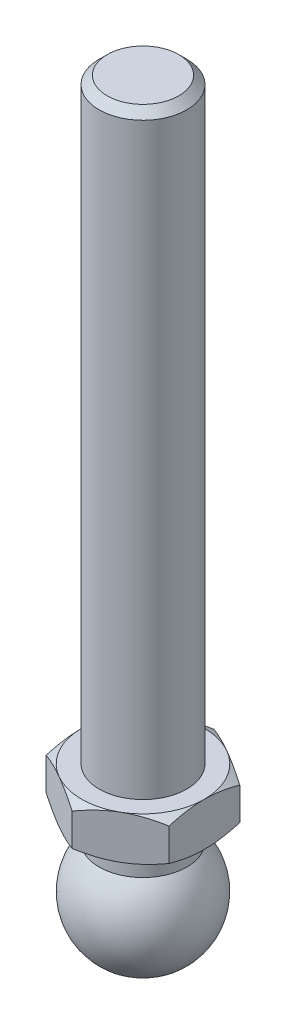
ISO-10303-21;
HEADER;
FILE_DESCRIPTION(('STEP AP214'),'2;1');
FILE_NAME('part.step','',(''),(''),'','','');
FILE_SCHEMA(('AUTOMOTIVE_DESIGN { 1 0 10303 214 1 1 1 1 }'));
ENDSEC;
DATA;
#1=APPLICATION_CONTEXT('core data for automotive mechanical design processes');
#2=APPLICATION_PROTOCOL_DEFINITION('international standard','automotive_design',2000,#1);
#3=PRODUCT_CONTEXT('',#1,'mechanical');
#4=PRODUCT('Part','Part','',(#3));
#5=PRODUCT_RELATED_PRODUCT_CATEGORY('part','',(#4));
#6=PRODUCT_DEFINITION_FORMATION('','',#4);
#7=PRODUCT_DEFINITION_CONTEXT('part definition',#1,'design');
#8=PRODUCT_DEFINITION('design','',#6,#7);
#9=PRODUCT_DEFINITION_SHAPE('','',#8);
#10=(LENGTH_UNIT() NAMED_UNIT(*) SI_UNIT(.MILLI.,.METRE.));
#11=(NAMED_UNIT(*) PLANE_ANGLE_UNIT() SI_UNIT($,.RADIAN.));
#12=(NAMED_UNIT(*) SI_UNIT($,.STERADIAN.) SOLID_ANGLE_UNIT());
#13=UNCERTAINTY_MEASURE_WITH_UNIT(LENGTH_MEASURE(1.E-05),#10,'distance_accuracy_value','');
#14=(GEOMETRIC_REPRESENTATION_CONTEXT(3) GLOBAL_UNCERTAINTY_ASSIGNED_CONTEXT((#13)) GLOBAL_UNIT_ASSIGNED_CONTEXT((#10,
#11,#12)) REPRESENTATION_CONTEXT('',''));
#15=CARTESIAN_POINT('',(0.,0.,0.));
#16=DIRECTION('',(0.,0.,1.));
#17=DIRECTION('',(1.,0.,0.));
#18=AXIS2_PLACEMENT_3D('',#15,#16,#17);
#19=CARTESIAN_POINT('',(0.,12.6,0.));
#20=DIRECTION('',(0.,-1.,0.));
#21=DIRECTION('',(0.,0.,-1.));
#22=AXIS2_PLACEMENT_3D('',#19,#20,#21);
#23=CONICAL_SURFACE('',#22,7.,1.0471975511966);
#24=CARTESIAN_POINT('',(-7.,8.53828268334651,12.1648696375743));
#25=CARTESIAN_POINT('',(-7.,8.68391573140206,11.8738003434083));
#26=CARTESIAN_POINT('',(-7.,8.82854589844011,11.5822239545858));
#27=CARTESIAN_POINT('',(-7.,9.11531569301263,10.997825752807));
#28=CARTESIAN_POINT('',(-7.,9.25745515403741,10.7050038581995));
#29=CARTESIAN_POINT('',(-7.,9.53902214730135,10.1173316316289));
#30=CARTESIAN_POINT('',(-7.,9.67844364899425,9.82247840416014));
#31=CARTESIAN_POINT('',(-7.,9.95360604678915,9.23106328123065));
#32=CARTESIAN_POINT('',(-7.,10.0893470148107,8.93450141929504));
#33=CARTESIAN_POINT('',(-7.,10.3623110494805,8.32593520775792));
#34=CARTESIAN_POINT('',(-7.,10.4993254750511,8.01383696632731));
#35=CARTESIAN_POINT('',(-7.,10.7671383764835,7.38695797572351));
#36=CARTESIAN_POINT('',(-7.,10.8979365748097,7.07217710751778));
#37=CARTESIAN_POINT('',(-7.,11.1515530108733,6.43962449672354));
#38=CARTESIAN_POINT('',(-7.,11.2743761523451,6.12185473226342));
#39=CARTESIAN_POINT('',(-7.,11.5099016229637,5.48260317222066));
#40=CARTESIAN_POINT('',(-7.,11.6226050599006,5.1611217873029));
#41=CARTESIAN_POINT('',(-7.,11.8599014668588,4.43821731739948));
#42=CARTESIAN_POINT('',(-7.,11.981118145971,4.03566892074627));
#43=CARTESIAN_POINT('',(-7.,12.1969740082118,3.22331060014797));
#44=CARTESIAN_POINT('',(-7.,12.2916155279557,2.8135013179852));
#45=CARTESIAN_POINT('',(-7.,12.4069999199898,2.19742561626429));
#46=CARTESIAN_POINT('',(-7.,12.4408518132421,1.99359214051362));
#47=CARTESIAN_POINT('',(-7.,12.4993191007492,1.58461613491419));
#48=CARTESIAN_POINT('',(-7.,12.5239358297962,1.37947379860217));
#49=CARTESIAN_POINT('',(-7.,12.5631968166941,0.968289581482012));
#50=CARTESIAN_POINT('',(-7.,12.5778439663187,0.76224797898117));
#51=CARTESIAN_POINT('',(-7.,12.5967021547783,0.349683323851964));
#52=CARTESIAN_POINT('',(-7.,12.6009132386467,0.143160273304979));
#53=CARTESIAN_POINT('',(-7.,12.5987493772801,-0.271082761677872));
#54=CARTESIAN_POINT('',(-7.,12.5923100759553,-0.47880240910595));
#55=CARTESIAN_POINT('',(-7.,12.5689433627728,-0.893645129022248));
#56=CARTESIAN_POINT('',(-7.,12.5520159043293,-1.10076819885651));
#57=CARTESIAN_POINT('',(-7.,12.5082124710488,-1.51403043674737));
#58=CARTESIAN_POINT('',(-7.,12.4813327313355,-1.72016920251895));
#59=CARTESIAN_POINT('',(-7.,12.4184180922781,-2.13103319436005));
#60=CARTESIAN_POINT('',(-7.,12.382382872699,-2.33575837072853));
#61=CARTESIAN_POINT('',(-7.,12.2605686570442,-2.95437912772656));
#62=CARTESIAN_POINT('',(-7.,12.1618729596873,-3.36575077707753));
#63=CARTESIAN_POINT('',(-7.,11.93845338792,-4.1813801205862));
#64=CARTESIAN_POINT('',(-7.,11.8137148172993,-4.58563365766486));
#65=CARTESIAN_POINT('',(-7.,11.573324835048,-5.30320893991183));
#66=CARTESIAN_POINT('',(-7.,11.4612875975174,-5.61775957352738));
#67=CARTESIAN_POINT('',(-7.,11.2278514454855,-6.24325021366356));
#68=CARTESIAN_POINT('',(-7.,11.1064551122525,-6.55419118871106));
#69=CARTESIAN_POINT('',(-7.,10.8562070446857,-7.17328528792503));
#70=CARTESIAN_POINT('',(-7.,10.7273503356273,-7.48143638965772));
#71=CARTESIAN_POINT('',(-7.,10.4637823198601,-8.09523802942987));
#72=CARTESIAN_POINT('',(-7.,10.3290706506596,-8.4008884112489));
#73=CARTESIAN_POINT('',(-7.,10.0607840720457,-8.99716345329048));
#74=CARTESIAN_POINT('',(-7.,9.92740317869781,-9.28787568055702));
#75=CARTESIAN_POINT('',(-7.,9.65714715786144,-9.86766295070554));
#76=CARTESIAN_POINT('',(-7.,9.52027208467,-10.1567380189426));
#77=CARTESIAN_POINT('',(-7.,9.24389786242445,-10.7329937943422));
#78=CARTESIAN_POINT('',(-7.,9.10440383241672,-11.0201769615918));
#79=CARTESIAN_POINT('',(-7.,8.8230228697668,-11.5933594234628));
#80=CARTESIAN_POINT('',(-7.,8.68113600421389,-11.879358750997));
#81=CARTESIAN_POINT('',(-7.,8.53828268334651,-12.1648696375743));
#82=B_SPLINE_CURVE_WITH_KNOTS('',3,(#24,#25,#26,#27,#28,#29,#30,#31,#32,#33,#34,#35,#36,#37,#38,
#39,#40,#41,#42,#43,#44,#45,#46,#47,#48,#49,#50,#51,#52,#53,#54,#55,#56,#57,#58,#59,#60,#61,#62,
#63,#64,#65,#66,#67,#68,#69,#70,#71,#72,#73,#74,#75,#76,#77,#78,#79,#80,#81),.UNSPECIFIED.,.F.,
.F.,(4,2,2,2,2,2,2,2,2,2,2,2,2,2,2,2,2,2,2,2,2,2,2,2,2,2,2,2,4),(0.,0.976413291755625,
1.9528916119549,2.9313342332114,3.90975772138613,4.93225217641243,5.95479223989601,
6.97669748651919,7.99849072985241,9.25906449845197,10.5195273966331,11.1392271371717,
11.758837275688,12.3782676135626,12.9976952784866,13.6208795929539,14.244066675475,
14.8674897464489,15.4909346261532,16.7587972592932,18.0273773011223,19.0289263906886,
20.0302002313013,21.0321496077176,22.034161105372,22.9936838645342,23.9531917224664,
24.9109871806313,25.8687558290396),.UNSPECIFIED.);
#83=CARTESIAN_POINT('',(-7.,11.9747852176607,4.04145188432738));
#84=VERTEX_POINT('',#83);
#85=CARTESIAN_POINT('',(-7.,12.6,0.));
#86=VERTEX_POINT('',#85);
#87=EDGE_CURVE('E309',#84,#86,#82,.T.);
#88=ORIENTED_EDGE('',*,*,#87,.F.);
#89=CARTESIAN_POINT('',(0.0002,11.9747185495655,8.0830192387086));
#90=CARTESIAN_POINT('',(-0.15366790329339,12.0260001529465,7.99418356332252));
#91=CARTESIAN_POINT('',(-0.308109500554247,12.0749544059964,7.90501666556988));
#92=CARTESIAN_POINT('',(-0.618246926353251,12.1675672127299,7.72595873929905));
#93=CARTESIAN_POINT('',(-0.773943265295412,12.2112234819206,7.63606741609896));
#94=CARTESIAN_POINT('',(-1.24352516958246,12.3333884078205,7.36495417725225));
#95=CARTESIAN_POINT('',(-1.5592643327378,12.4028744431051,7.18266208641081));
#96=CARTESIAN_POINT('',(-2.03176224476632,12.4843550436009,6.9098652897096));
#97=CARTESIAN_POINT('',(-2.18710922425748,12.5075665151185,6.82017566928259));
#98=CARTESIAN_POINT('',(-2.49850511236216,12.5464887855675,6.64039116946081));
#99=CARTESIAN_POINT('',(-2.6545539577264,12.5622002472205,6.55029632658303));
#100=CARTESIAN_POINT('',(-2.96692267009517,12.5857220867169,6.36995016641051));
#101=CARTESIAN_POINT('',(-3.12324202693,12.5935414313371,6.27969914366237));
#102=CARTESIAN_POINT('',(-3.43601650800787,12.6011197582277,6.09911871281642));
#103=CARTESIAN_POINT('',(-3.59247162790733,12.600878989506,6.00878930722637));
#104=CARTESIAN_POINT('',(-4.02110687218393,12.5891402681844,5.76131663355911));
#105=CARTESIAN_POINT('',(-4.29314668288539,12.5694342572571,5.60425437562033));
#106=CARTESIAN_POINT('',(-4.83541944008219,12.5069465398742,5.29117305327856));
#107=CARTESIAN_POINT('',(-5.10565047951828,12.464143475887,5.13515508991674));
#108=CARTESIAN_POINT('',(-5.64901454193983,12.3571483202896,4.82144370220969));
#109=CARTESIAN_POINT('',(-5.92207900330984,12.2925029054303,4.66378986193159));
#110=CARTESIAN_POINT('',(-6.46413578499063,12.145783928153,4.35083323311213));
#111=CARTESIAN_POINT('',(-6.73313504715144,12.0637448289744,4.19552643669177));
#112=CARTESIAN_POINT('',(-7.0002,11.9747185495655,4.04133641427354));
#113=B_SPLINE_CURVE_WITH_KNOTS('',3,(#89,#90,#91,#92,#93,#94,#95,#96,#97,#98,#99,#100,#101,#102,
#103,#104,#105,#106,#107,#108,#109,#110,#111,#112),.UNSPECIFIED.,.F.,.F.,(4,2,2,2,2,2,2,2,2,2,2,
4),(0.,0.554727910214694,1.10969417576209,2.2219327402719,2.76443041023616,3.30688013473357,
3.84871284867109,4.39052882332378,5.33376515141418,6.27787517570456,7.2429241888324,
8.20607866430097),.UNSPECIFIED.);
#114=CARTESIAN_POINT('',(-3.5,12.6,6.06217782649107));
#115=VERTEX_POINT('',#114);
#116=EDGE_CURVE('E135',#115,#84,#113,.T.);
#117=ORIENTED_EDGE('',*,*,#116,.F.);
#118=CARTESIAN_POINT('',(0.,12.6,0.));
#119=DIRECTION('',(0.,-1.,0.));
#120=DIRECTION('',(0.,0.,-1.));
#121=AXIS2_PLACEMENT_3D('',#118,#119,#120);
#122=CIRCLE('',#121,7.);
#123=EDGE_CURVE('E283',#115,#86,#122,.T.);
#124=ORIENTED_EDGE('',*,*,#123,.T.);
#125=EDGE_LOOP('',(#88,#117,#124));
#126=FACE_BOUND('',#125,.T.);
#127=ADVANCED_FACE('F14',(#126),#23,.T.);
#128=CARTESIAN_POINT('',(-7.,11.9747852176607,-4.04145188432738));
#129=VERTEX_POINT('',#128);
#130=EDGE_CURVE('E193',#86,#129,#82,.T.);
#131=ORIENTED_EDGE('',*,*,#130,.F.);
#132=CARTESIAN_POINT('',(-3.5,12.6,-6.06217782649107));
#133=VERTEX_POINT('',#132);
#134=EDGE_CURVE('E195',#86,#133,#122,.T.);
#135=ORIENTED_EDGE('',*,*,#134,.T.);
#136=CARTESIAN_POINT('',(-7.0002,11.9747185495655,-4.04133641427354));
#137=CARTESIAN_POINT('',(-6.84633209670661,12.0260001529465,-4.13017208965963));
#138=CARTESIAN_POINT('',(-6.69189049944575,12.0749544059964,-4.21933898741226));
#139=CARTESIAN_POINT('',(-6.38175307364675,12.1675672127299,-4.39839691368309));
#140=CARTESIAN_POINT('',(-6.22605673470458,12.2112234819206,-4.48828823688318));
#141=CARTESIAN_POINT('',(-5.75647483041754,12.3333884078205,-4.75940147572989));
#142=CARTESIAN_POINT('',(-5.4407356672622,12.4028744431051,-4.94169356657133));
#143=CARTESIAN_POINT('',(-4.96823775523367,12.4843550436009,-5.21449036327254));
#144=CARTESIAN_POINT('',(-4.81289077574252,12.5075665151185,-5.30417998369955));
#145=CARTESIAN_POINT('',(-4.50149488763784,12.5464887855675,-5.48396448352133));
#146=CARTESIAN_POINT('',(-4.3454460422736,12.5622002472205,-5.5740593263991));
#147=CARTESIAN_POINT('',(-4.03307732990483,12.5857220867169,-5.75440548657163));
#148=CARTESIAN_POINT('',(-3.87675797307,12.5935414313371,-5.84465650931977));
#149=CARTESIAN_POINT('',(-3.56398349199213,12.6011197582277,-6.02523694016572));
#150=CARTESIAN_POINT('',(-3.40752837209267,12.600878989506,-6.11556634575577));
#151=CARTESIAN_POINT('',(-2.97889312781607,12.5891402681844,-6.36303901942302));
#152=CARTESIAN_POINT('',(-2.70685331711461,12.5694342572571,-6.52010127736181));
#153=CARTESIAN_POINT('',(-2.16458055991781,12.5069465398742,-6.83318259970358));
#154=CARTESIAN_POINT('',(-1.89434952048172,12.464143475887,-6.9892005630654));
#155=CARTESIAN_POINT('',(-1.35098545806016,12.3571483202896,-7.30291195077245));
#156=CARTESIAN_POINT('',(-1.07792099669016,12.2925029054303,-7.46056579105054));
#157=CARTESIAN_POINT('',(-0.535864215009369,12.145783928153,-7.77352241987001));
#158=CARTESIAN_POINT('',(-0.266864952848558,12.0637448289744,-7.92882921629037));
#159=CARTESIAN_POINT('',(0.000200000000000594,11.9747185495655,-8.0830192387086));
#160=B_SPLINE_CURVE_WITH_KNOTS('',3,(#136,#137,#138,#139,#140,#141,#142,#143,#144,#145,#146,
#147,#148,#149,#150,#151,#152,#153,#154,#155,#156,#157,#158,#159),.UNSPECIFIED.,.F.,.F.,(4,2,2,
2,2,2,2,2,2,2,2,4),(0.,0.554727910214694,1.10969417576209,2.22193274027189,2.76443041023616,
3.30688013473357,3.84871284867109,4.39052882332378,5.33376515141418,6.27787517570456,
7.2429241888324,8.20607866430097),.UNSPECIFIED.);
#161=EDGE_CURVE('E183',#129,#133,#160,.T.);
#162=ORIENTED_EDGE('',*,*,#161,.F.);
#163=EDGE_LOOP('',(#131,#135,#162));
#164=FACE_BOUND('',#163,.T.);
#165=ADVANCED_FACE('F192',(#164),#23,.T.);
#166=CARTESIAN_POINT('',(0.,11.9747852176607,-8.08290376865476));
#167=VERTEX_POINT('',#166);
#168=EDGE_CURVE('E197',#133,#167,#160,.T.);
#169=ORIENTED_EDGE('',*,*,#168,.F.);
#170=CARTESIAN_POINT('',(3.5,12.6,-6.06217782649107));
#171=VERTEX_POINT('',#170);
#172=EDGE_CURVE('E293',#133,#171,#122,.T.);
#173=ORIENTED_EDGE('',*,*,#172,.T.);
#174=CARTESIAN_POINT('',(-0.0002,11.9747185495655,-8.0830192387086));
#175=CARTESIAN_POINT('',(0.15366790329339,12.0260001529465,-7.99418356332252));
#176=CARTESIAN_POINT('',(0.308109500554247,12.0749544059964,-7.90501666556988));
#177=CARTESIAN_POINT('',(0.618246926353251,12.1675672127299,-7.72595873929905));
#178=CARTESIAN_POINT('',(0.773943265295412,12.2112234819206,-7.63606741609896));
#179=CARTESIAN_POINT('',(1.24352516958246,12.3333884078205,-7.36495417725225));
#180=CARTESIAN_POINT('',(1.5592643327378,12.4028744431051,-7.18266208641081));
#181=CARTESIAN_POINT('',(2.03176224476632,12.4843550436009,-6.9098652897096));
#182=CARTESIAN_POINT('',(2.18710922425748,12.5075665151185,-6.82017566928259));
#183=CARTESIAN_POINT('',(2.49850511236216,12.5464887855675,-6.64039116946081));
#184=CARTESIAN_POINT('',(2.6545539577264,12.5622002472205,-6.55029632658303));
#185=CARTESIAN_POINT('',(2.96692267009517,12.5857220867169,-6.36995016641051));
#186=CARTESIAN_POINT('',(3.12324202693,12.5935414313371,-6.27969914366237));
#187=CARTESIAN_POINT('',(3.43601650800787,12.6011197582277,-6.09911871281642));
#188=CARTESIAN_POINT('',(3.59247162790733,12.600878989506,-6.00878930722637));
#189=CARTESIAN_POINT('',(4.02110687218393,12.5891402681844,-5.76131663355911));
#190=CARTESIAN_POINT('',(4.29314668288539,12.5694342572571,-5.60425437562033));
#191=CARTESIAN_POINT('',(4.83541944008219,12.5069465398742,-5.29117305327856));
#192=CARTESIAN_POINT('',(5.10565047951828,12.464143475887,-5.13515508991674));
#193=CARTESIAN_POINT('',(5.64901454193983,12.3571483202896,-4.82144370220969));
#194=CARTESIAN_POINT('',(5.92207900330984,12.2925029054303,-4.66378986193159));
#195=CARTESIAN_POINT('',(6.46413578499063,12.145783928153,-4.35083323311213));
#196=CARTESIAN_POINT('',(6.73313504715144,12.0637448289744,-4.19552643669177));
#197=CARTESIAN_POINT('',(7.0002,11.9747185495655,-4.04133641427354));
#198=B_SPLINE_CURVE_WITH_KNOTS('',3,(#174,#175,#176,#177,#178,#179,#180,#181,#182,#183,#184,
#185,#186,#187,#188,#189,#190,#191,#192,#193,#194,#195,#196,#197),.UNSPECIFIED.,.F.,.F.,(4,2,2,
2,2,2,2,2,2,2,2,4),(0.,0.554727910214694,1.10969417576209,2.2219327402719,2.76443041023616,
3.30688013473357,3.84871284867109,4.39052882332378,5.33376515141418,6.27787517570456,
7.2429241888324,8.20607866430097),.UNSPECIFIED.);
#199=EDGE_CURVE('E243',#167,#171,#198,.T.);
#200=ORIENTED_EDGE('',*,*,#199,.F.);
#201=EDGE_LOOP('',(#169,#173,#200));
#202=FACE_BOUND('',#201,.T.);
#203=ADVANCED_FACE('F342',(#202),#23,.T.);
#204=CARTESIAN_POINT('',(7.,11.9747852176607,-4.04145188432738));
#205=VERTEX_POINT('',#204);
#206=EDGE_CURVE('E238',#171,#205,#198,.T.);
#207=ORIENTED_EDGE('',*,*,#206,.F.);
#208=CARTESIAN_POINT('',(7.,12.6,0.));
#209=VERTEX_POINT('',#208);
#210=EDGE_CURVE('E288',#171,#209,#122,.T.);
#211=ORIENTED_EDGE('',*,*,#210,.T.);
#212=CARTESIAN_POINT('',(7.,8.53828268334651,-12.1648696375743));
#213=CARTESIAN_POINT('',(7.,8.68391573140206,-11.8738003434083));
#214=CARTESIAN_POINT('',(7.,8.82854589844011,-11.5822239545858));
#215=CARTESIAN_POINT('',(7.,9.11531569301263,-10.997825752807));
#216=CARTESIAN_POINT('',(7.,9.25745515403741,-10.7050038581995));
#217=CARTESIAN_POINT('',(7.,9.53902214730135,-10.1173316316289));
#218=CARTESIAN_POINT('',(7.,9.67844364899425,-9.82247840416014));
#219=CARTESIAN_POINT('',(7.,9.95360604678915,-9.23106328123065));
#220=CARTESIAN_POINT('',(7.,10.0893470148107,-8.93450141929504));
#221=CARTESIAN_POINT('',(7.,10.3623110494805,-8.32593520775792));
#222=CARTESIAN_POINT('',(7.,10.4993254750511,-8.01383696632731));
#223=CARTESIAN_POINT('',(7.,10.7671383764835,-7.38695797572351));
#224=CARTESIAN_POINT('',(7.,10.8979365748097,-7.07217710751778));
#225=CARTESIAN_POINT('',(7.,11.1515530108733,-6.43962449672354));
#226=CARTESIAN_POINT('',(7.,11.2743761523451,-6.12185473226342));
#227=CARTESIAN_POINT('',(7.,11.5099016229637,-5.48260317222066));
#228=CARTESIAN_POINT('',(7.,11.6226050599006,-5.1611217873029));
#229=CARTESIAN_POINT('',(7.,11.8599014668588,-4.43821731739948));
#230=CARTESIAN_POINT('',(7.,11.981118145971,-4.03566892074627));
#231=CARTESIAN_POINT('',(7.,12.1969740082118,-3.22331060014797));
#232=CARTESIAN_POINT('',(7.,12.2916155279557,-2.8135013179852));
#233=CARTESIAN_POINT('',(7.,12.4069999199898,-2.19742561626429));
#234=CARTESIAN_POINT('',(7.,12.4408518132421,-1.99359214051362));
#235=CARTESIAN_POINT('',(7.,12.4993191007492,-1.58461613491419));
#236=CARTESIAN_POINT('',(7.,12.5239358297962,-1.37947379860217));
#237=CARTESIAN_POINT('',(7.,12.5631968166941,-0.968289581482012));
#238=CARTESIAN_POINT('',(7.,12.5778439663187,-0.76224797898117));
#239=CARTESIAN_POINT('',(7.,12.5967021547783,-0.349683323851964));
#240=CARTESIAN_POINT('',(7.,12.6009132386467,-0.143160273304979));
#241=CARTESIAN_POINT('',(7.,12.5987493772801,0.271082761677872));
#242=CARTESIAN_POINT('',(7.,12.5923100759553,0.47880240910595));
#243=CARTESIAN_POINT('',(7.,12.5689433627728,0.893645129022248));
#244=CARTESIAN_POINT('',(7.,12.5520159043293,1.10076819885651));
#245=CARTESIAN_POINT('',(7.,12.5082124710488,1.51403043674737));
#246=CARTESIAN_POINT('',(7.,12.4813327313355,1.72016920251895));
#247=CARTESIAN_POINT('',(7.,12.4184180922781,2.13103319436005));
#248=CARTESIAN_POINT('',(7.,12.382382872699,2.33575837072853));
#249=CARTESIAN_POINT('',(7.,12.2605686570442,2.95437912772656));
#250=CARTESIAN_POINT('',(7.,12.1618729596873,3.36575077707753));
#251=CARTESIAN_POINT('',(7.,11.93845338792,4.1813801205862));
#252=CARTESIAN_POINT('',(7.,11.8137148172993,4.58563365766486));
#253=CARTESIAN_POINT('',(7.,11.573324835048,5.30320893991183));
#254=CARTESIAN_POINT('',(7.,11.4612875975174,5.61775957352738));
#255=CARTESIAN_POINT('',(7.,11.2278514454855,6.24325021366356));
#256=CARTESIAN_POINT('',(7.,11.1064551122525,6.55419118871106));
#257=CARTESIAN_POINT('',(7.,10.8562070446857,7.17328528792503));
#258=CARTESIAN_POINT('',(7.,10.7273503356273,7.48143638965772));
#259=CARTESIAN_POINT('',(7.,10.4637823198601,8.09523802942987));
#260=CARTESIAN_POINT('',(7.,10.3290706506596,8.4008884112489));
#261=CARTESIAN_POINT('',(7.,10.0607840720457,8.99716345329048));
#262=CARTESIAN_POINT('',(7.,9.92740317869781,9.28787568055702));
#263=CARTESIAN_POINT('',(7.,9.65714715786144,9.86766295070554));
#264=CARTESIAN_POINT('',(7.,9.52027208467,10.1567380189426));
#265=CARTESIAN_POINT('',(7.,9.24389786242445,10.7329937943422));
#266=CARTESIAN_POINT('',(7.,9.10440383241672,11.0201769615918));
#267=CARTESIAN_POINT('',(7.,8.8230228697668,11.5933594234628));
#268=CARTESIAN_POINT('',(7.,8.68113600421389,11.879358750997));
#269=CARTESIAN_POINT('',(7.,8.53828268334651,12.1648696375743));
#270=B_SPLINE_CURVE_WITH_KNOTS('',3,(#212,#213,#214,#215,#216,#217,#218,#219,#220,#221,#222,
#223,#224,#225,#226,#227,#228,#229,#230,#231,#232,#233,#234,#235,#236,#237,#238,#239,#240,#241,
#242,#243,#244,#245,#246,#247,#248,#249,#250,#251,#252,#253,#254,#255,#256,#257,#258,#259,#260,
#261,#262,#263,#264,#265,#266,#267,#268,#269),.UNSPECIFIED.,.F.,.F.,(4,2,2,2,2,2,2,2,2,2,2,2,2,
2,2,2,2,2,2,2,2,2,2,2,2,2,2,2,4),(0.,0.976413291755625,1.9528916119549,2.9313342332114,
3.90975772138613,4.93225217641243,5.95479223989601,6.97669748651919,7.99849072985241,
9.25906449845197,10.5195273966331,11.1392271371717,11.758837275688,12.3782676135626,
12.9976952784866,13.6208795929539,14.244066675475,14.8674897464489,15.4909346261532,
16.7587972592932,18.0273773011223,19.0289263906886,20.0302002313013,21.0321496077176,
22.034161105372,22.9936838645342,23.9531917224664,24.9109871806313,25.8687558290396),.UNSPECIFIED.);
#271=EDGE_CURVE('E249',#205,#209,#270,.T.);
#272=ORIENTED_EDGE('',*,*,#271,.F.);
#273=EDGE_LOOP('',(#207,#211,#272));
#274=FACE_BOUND('',#273,.T.);
#275=ADVANCED_FACE('F352',(#274),#23,.T.);
#276=CARTESIAN_POINT('',(7.,11.9747852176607,4.04145188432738));
#277=VERTEX_POINT('',#276);
#278=EDGE_CURVE('E251',#209,#277,#270,.T.);
#279=ORIENTED_EDGE('',*,*,#278,.F.);
#280=CARTESIAN_POINT('',(3.5,12.6,6.06217782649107));
#281=VERTEX_POINT('',#280);
#282=EDGE_CURVE('E281',#209,#281,#122,.T.);
#283=ORIENTED_EDGE('',*,*,#282,.T.);
#284=CARTESIAN_POINT('',(7.0002,11.9747185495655,4.04133641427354));
#285=CARTESIAN_POINT('',(6.84633209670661,12.0260001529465,4.13017208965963));
#286=CARTESIAN_POINT('',(6.69189049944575,12.0749544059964,4.21933898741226));
#287=CARTESIAN_POINT('',(6.38175307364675,12.1675672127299,4.39839691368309));
#288=CARTESIAN_POINT('',(6.22605673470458,12.2112234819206,4.48828823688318));
#289=CARTESIAN_POINT('',(5.75647483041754,12.3333884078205,4.75940147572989));
#290=CARTESIAN_POINT('',(5.4407356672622,12.4028744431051,4.94169356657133));
#291=CARTESIAN_POINT('',(4.96823775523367,12.4843550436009,5.21449036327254));
#292=CARTESIAN_POINT('',(4.81289077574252,12.5075665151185,5.30417998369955));
#293=CARTESIAN_POINT('',(4.50149488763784,12.5464887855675,5.48396448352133));
#294=CARTESIAN_POINT('',(4.3454460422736,12.5622002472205,5.5740593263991));
#295=CARTESIAN_POINT('',(4.03307732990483,12.5857220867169,5.75440548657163));
#296=CARTESIAN_POINT('',(3.87675797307,12.5935414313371,5.84465650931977));
#297=CARTESIAN_POINT('',(3.56398349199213,12.6011197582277,6.02523694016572));
#298=CARTESIAN_POINT('',(3.40752837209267,12.600878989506,6.11556634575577));
#299=CARTESIAN_POINT('',(2.97889312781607,12.5891402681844,6.36303901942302));
#300=CARTESIAN_POINT('',(2.70685331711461,12.5694342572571,6.52010127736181));
#301=CARTESIAN_POINT('',(2.16458055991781,12.5069465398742,6.83318259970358));
#302=CARTESIAN_POINT('',(1.89434952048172,12.464143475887,6.9892005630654));
#303=CARTESIAN_POINT('',(1.35098545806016,12.3571483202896,7.30291195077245));
#304=CARTESIAN_POINT('',(1.07792099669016,12.2925029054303,7.46056579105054));
#305=CARTESIAN_POINT('',(0.535864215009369,12.145783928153,7.77352241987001));
#306=CARTESIAN_POINT('',(0.266864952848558,12.0637448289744,7.92882921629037));
#307=CARTESIAN_POINT('',(-0.000200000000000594,11.9747185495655,8.0830192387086));
#308=B_SPLINE_CURVE_WITH_KNOTS('',3,(#284,#285,#286,#287,#288,#289,#290,#291,#292,#293,#294,
#295,#296,#297,#298,#299,#300,#301,#302,#303,#304,#305,#306,#307),.UNSPECIFIED.,.F.,.F.,(4,2,2,
2,2,2,2,2,2,2,2,4),(0.,0.554727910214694,1.10969417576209,2.22193274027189,2.76443041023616,
3.30688013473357,3.84871284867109,4.39052882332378,5.33376515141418,6.27787517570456,
7.2429241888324,8.20607866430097),.UNSPECIFIED.);
#309=EDGE_CURVE('E126',#277,#281,#308,.T.);
#310=ORIENTED_EDGE('',*,*,#309,.F.);
#311=EDGE_LOOP('',(#279,#283,#310));
#312=FACE_BOUND('',#311,.T.);
#313=ADVANCED_FACE('F285',(#312),#23,.T.);
#314=CARTESIAN_POINT('',(0.,11.9747852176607,8.08290376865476));
#315=VERTEX_POINT('',#314);
#316=EDGE_CURVE('E116',#281,#315,#308,.T.);
#317=ORIENTED_EDGE('',*,*,#316,.F.);
#318=EDGE_CURVE('E274',#281,#115,#122,.T.);
#319=ORIENTED_EDGE('',*,*,#318,.T.);
#320=EDGE_CURVE('E29',#315,#115,#113,.T.);
#321=ORIENTED_EDGE('',*,*,#320,.F.);
#322=EDGE_LOOP('',(#317,#319,#321));
#323=FACE_BOUND('',#322,.T.);
#324=ADVANCED_FACE('F273',(#323),#23,.T.);
#325=CARTESIAN_POINT('',(0.,80.6,0.));
#326=DIRECTION('',(0.,-1.,0.));
#327=DIRECTION('',(0.,0.,-1.));
#328=AXIS2_PLACEMENT_3D('',#325,#326,#327);
#329=PLANE('',#328);
#330=CARTESIAN_POINT('',(0.,80.6,0.));
#331=DIRECTION('',(0.,-1.,0.));
#332=DIRECTION('',(0.,0.,-1.));
#333=AXIS2_PLACEMENT_3D('',#330,#331,#332);
#334=CIRCLE('',#333,4.08);
#335=CARTESIAN_POINT('',(0.,80.6,-4.08));
#336=VERTEX_POINT('',#335);
#337=EDGE_CURVE('E22',#336,#336,#334,.T.);
#338=ORIENTED_EDGE('',*,*,#337,.F.);
#339=EDGE_LOOP('',(#338));
#340=FACE_BOUND('',#339,.T.);
#341=ADVANCED_FACE('F16',(#340),#329,.F.);
#342=CARTESIAN_POINT('',(0.,80.6,0.));
#343=DIRECTION('',(0.,-1.,0.));
#344=DIRECTION('',(0.,0.,-1.));
#345=AXIS2_PLACEMENT_3D('',#342,#343,#344);
#346=CONICAL_SURFACE('',#345,4.08,0.785398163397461);
#347=CARTESIAN_POINT('',(0.,79.68,0.));
#348=DIRECTION('',(0.,-1.,0.));
#349=DIRECTION('',(0.,0.,-1.));
#350=AXIS2_PLACEMENT_3D('',#347,#348,#349);
#351=CIRCLE('',#350,5.);
#352=CARTESIAN_POINT('',(0.,79.68,-5.));
#353=VERTEX_POINT('',#352);
#354=EDGE_CURVE('E290',#353,#353,#351,.T.);
#355=ORIENTED_EDGE('',*,*,#354,.F.);
#356=EDGE_LOOP('',(#355));
#357=FACE_BOUND('',#356,.T.);
#358=ORIENTED_EDGE('',*,*,#337,.T.);
#359=EDGE_LOOP('',(#358));
#360=FACE_BOUND('',#359,.T.);
#361=ADVANCED_FACE('F350',(#357,#360),#346,.T.);
#362=CARTESIAN_POINT('',(0.,-7.,0.));
#363=DIRECTION('',(0.,-1.,0.));
#364=DIRECTION('',(0.,0.,-1.));
#365=AXIS2_PLACEMENT_3D('',#362,#363,#364);
#366=CYLINDRICAL_SURFACE('',#365,5.);
#367=CARTESIAN_POINT('',(0.,12.6,0.));
#368=DIRECTION('',(0.,-1.,0.));
#369=DIRECTION('',(0.,0.,-1.));
#370=AXIS2_PLACEMENT_3D('',#367,#368,#369);
#371=CIRCLE('',#370,5.);
#372=CARTESIAN_POINT('',(0.,12.6,-5.));
#373=VERTEX_POINT('',#372);
#374=EDGE_CURVE('E287',#373,#373,#371,.T.);
#375=ORIENTED_EDGE('',*,*,#374,.F.);
#376=EDGE_LOOP('',(#375));
#377=FACE_BOUND('',#376,.T.);
#378=ORIENTED_EDGE('',*,*,#354,.T.);
#379=EDGE_LOOP('',(#378));
#380=FACE_BOUND('',#379,.T.);
#381=ADVANCED_FACE('F427',(#377,#380),#366,.T.);
#382=CARTESIAN_POINT('',(5.,12.6,0.));
#383=DIRECTION('',(0.,-1.,0.));
#384=DIRECTION('',(0.,0.,-1.));
#385=AXIS2_PLACEMENT_3D('',#382,#383,#384);
#386=PLANE('',#385);
#387=ORIENTED_EDGE('',*,*,#282,.F.);
#388=ORIENTED_EDGE('',*,*,#210,.F.);
#389=ORIENTED_EDGE('',*,*,#172,.F.);
#390=ORIENTED_EDGE('',*,*,#134,.F.);
#391=ORIENTED_EDGE('',*,*,#123,.F.);
#392=ORIENTED_EDGE('',*,*,#318,.F.);
#393=EDGE_LOOP('',(#387,#388,#389,#390,#391,#392));
#394=FACE_BOUND('',#393,.T.);
#395=ORIENTED_EDGE('',*,*,#374,.T.);
#396=EDGE_LOOP('',(#395));
#397=FACE_BOUND('',#396,.T.);
#398=ADVANCED_FACE('F278',(#394,#397),#386,.F.);
#399=CARTESIAN_POINT('',(-7.,7.65,-4.04145188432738));
#400=DIRECTION('',(-1.,0.,0.));
#401=DIRECTION('',(0.,0.,1.));
#402=AXIS2_PLACEMENT_3D('',#399,#400,#401);
#403=PLANE('',#402);
#404=ORIENTED_EDGE('',*,*,#87,.T.);
#405=ORIENTED_EDGE('',*,*,#130,.T.);
#406=DIRECTION('',(0.,1.,0.));
#407=VECTOR('',#406,1.);
#408=CARTESIAN_POINT('',(-7.,7.65,-4.04145188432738));
#409=LINE('',#408,#407);
#410=CARTESIAN_POINT('',(-7.,8.27521478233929,-4.04145188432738));
#411=VERTEX_POINT('',#410);
#412=EDGE_CURVE('E109',#411,#129,#409,.T.);
#413=ORIENTED_EDGE('',*,*,#412,.F.);
#414=CARTESIAN_POINT('',(-7.,11.7117173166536,-12.1648696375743));
#415=CARTESIAN_POINT('',(-7.,11.566084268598,-11.8738003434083));
#416=CARTESIAN_POINT('',(-7.,11.42145410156,-11.5822239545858));
#417=CARTESIAN_POINT('',(-7.,11.1346843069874,-10.997825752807));
#418=CARTESIAN_POINT('',(-7.,10.9925448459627,-10.7050038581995));
#419=CARTESIAN_POINT('',(-7.,10.7109778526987,-10.1173316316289));
#420=CARTESIAN_POINT('',(-7.,10.5715563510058,-9.82247840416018));
#421=CARTESIAN_POINT('',(-7.,10.2963939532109,-9.2310632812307));
#422=CARTESIAN_POINT('',(-7.,10.1606529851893,-8.93450141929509));
#423=CARTESIAN_POINT('',(-7.,9.88768895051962,-8.32593520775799));
#424=CARTESIAN_POINT('',(-7.,9.75067452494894,-8.01383696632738));
#425=CARTESIAN_POINT('',(-7.,9.48286162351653,-7.38695797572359));
#426=CARTESIAN_POINT('',(-7.,9.3520634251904,-7.07217710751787));
#427=CARTESIAN_POINT('',(-7.,9.09844698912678,-6.43962449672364));
#428=CARTESIAN_POINT('',(-7.,8.97562384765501,-6.12185473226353));
#429=CARTESIAN_POINT('',(-7.,8.7400983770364,-5.48260317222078));
#430=CARTESIAN_POINT('',(-7.,8.62739494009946,-5.16112178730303));
#431=CARTESIAN_POINT('',(-7.,8.39009853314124,-4.43821731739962));
#432=CARTESIAN_POINT('',(-7.,8.26888185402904,-4.03566892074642));
#433=CARTESIAN_POINT('',(-7.,8.05302599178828,-3.22331060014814));
#434=CARTESIAN_POINT('',(-7.,7.95838447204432,-2.81350131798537));
#435=CARTESIAN_POINT('',(-7.,7.84300008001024,-2.19742561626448));
#436=CARTESIAN_POINT('',(-7.,7.80914818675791,-1.99359214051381));
#437=CARTESIAN_POINT('',(-7.,7.75068089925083,-1.58461613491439));
#438=CARTESIAN_POINT('',(-7.,7.7260641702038,-1.37947379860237));
#439=CARTESIAN_POINT('',(-7.,7.68680318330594,-0.968289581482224));
#440=CARTESIAN_POINT('',(-7.,7.67215603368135,-0.762247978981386));
#441=CARTESIAN_POINT('',(-7.,7.65329784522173,-0.349683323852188));
#442=CARTESIAN_POINT('',(-7.,7.64908676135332,-0.143160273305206));
#443=CARTESIAN_POINT('',(-7.,7.65125062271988,0.27108276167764));
#444=CARTESIAN_POINT('',(-7.,7.65768992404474,0.478802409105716));
#445=CARTESIAN_POINT('',(-7.,7.68105663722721,0.893645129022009));
#446=CARTESIAN_POINT('',(-7.,7.69798409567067,1.10076819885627));
#447=CARTESIAN_POINT('',(-7.,7.74178752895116,1.51403043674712));
#448=CARTESIAN_POINT('',(-7.,7.76866726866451,1.7201692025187));
#449=CARTESIAN_POINT('',(-7.,7.83158190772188,2.1310331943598));
#450=CARTESIAN_POINT('',(-7.,7.86761712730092,2.33575837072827));
#451=CARTESIAN_POINT('',(-7.,7.98943134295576,2.95437912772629));
#452=CARTESIAN_POINT('',(-7.,8.08812704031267,3.36575077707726));
#453=CARTESIAN_POINT('',(-7.,8.31154661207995,4.18138012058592));
#454=CARTESIAN_POINT('',(-7.,8.43628518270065,4.58563365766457));
#455=CARTESIAN_POINT('',(-7.,8.67667516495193,5.30320893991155));
#456=CARTESIAN_POINT('',(-7.,8.78871240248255,5.61775957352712));
#457=CARTESIAN_POINT('',(-7.,9.02214855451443,6.24325021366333));
#458=CARTESIAN_POINT('',(-7.,9.14354488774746,6.55419118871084));
#459=CARTESIAN_POINT('',(-7.,9.3937929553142,7.17328528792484));
#460=CARTESIAN_POINT('',(-7.,9.52264966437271,7.48143638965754));
#461=CARTESIAN_POINT('',(-7.,9.78621768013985,8.09523802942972));
#462=CARTESIAN_POINT('',(-7.,9.92092934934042,8.40088841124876));
#463=CARTESIAN_POINT('',(-7.,10.1892159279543,8.99716345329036));
#464=CARTESIAN_POINT('',(-7.,10.3225968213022,9.28787568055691));
#465=CARTESIAN_POINT('',(-7.,10.5928528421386,9.86766295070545));
#466=CARTESIAN_POINT('',(-7.,10.72972791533,10.1567380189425));
#467=CARTESIAN_POINT('',(-7.,11.0061021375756,10.7329937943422));
#468=CARTESIAN_POINT('',(-7.,11.1455961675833,11.0201769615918));
#469=CARTESIAN_POINT('',(-7.,11.4269771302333,11.5933594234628));
#470=CARTESIAN_POINT('',(-7.,11.5688639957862,11.879358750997));
#471=CARTESIAN_POINT('',(-7.,11.7117173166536,12.1648696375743));
#472=B_SPLINE_CURVE_WITH_KNOTS('',3,(#414,#415,#416,#417,#418,#419,#420,#421,#422,#423,#424,
#425,#426,#427,#428,#429,#430,#431,#432,#433,#434,#435,#436,#437,#438,#439,#440,#441,#442,#443,
#444,#445,#446,#447,#448,#449,#450,#451,#452,#453,#454,#455,#456,#457,#458,#459,#460,#461,#462,
#463,#464,#465,#466,#467,#468,#469,#470,#471),.UNSPECIFIED.,.F.,.F.,(4,2,2,2,2,2,2,2,2,2,2,2,2,
2,2,2,2,2,2,2,2,2,2,2,2,2,2,2,4),(0.,0.976413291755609,1.95289161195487,2.93133423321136,
3.90975772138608,4.93225217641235,5.95479223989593,6.97669748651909,7.99849072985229,
9.25906449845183,10.5195273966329,11.1392271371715,11.7588372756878,12.3782676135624,
12.9976952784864,13.6208795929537,14.2440666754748,14.8674897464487,15.490934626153,
16.758797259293,18.027377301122,19.0289263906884,20.0302002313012,21.0321496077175,
22.0341611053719,22.9936838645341,23.9531917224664,24.9109871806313,25.8687558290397),.UNSPECIFIED.);
#473=CARTESIAN_POINT('',(-7.,7.65,0.));
#474=VERTEX_POINT('',#473);
#475=EDGE_CURVE('E199',#411,#474,#472,.T.);
#476=ORIENTED_EDGE('',*,*,#475,.T.);
#477=CARTESIAN_POINT('',(-7.,8.27521478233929,4.04145188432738));
#478=VERTEX_POINT('',#477);
#479=EDGE_CURVE('E196',#474,#478,#472,.T.);
#480=ORIENTED_EDGE('',*,*,#479,.T.);
#481=DIRECTION('',(0.,1.,0.));
#482=VECTOR('',#481,1.);
#483=CARTESIAN_POINT('',(-7.,7.65,4.04145188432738));
#484=LINE('',#483,#482);
#485=EDGE_CURVE('E118',#478,#84,#484,.T.);
#486=ORIENTED_EDGE('',*,*,#485,.T.);
#487=EDGE_LOOP('',(#404,#405,#413,#476,#480,#486));
#488=FACE_BOUND('',#487,.T.);
#489=ADVANCED_FACE('F224',(#488),#403,.T.);
#490=CARTESIAN_POINT('',(0.,7.65,-8.08290376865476));
#491=DIRECTION('',(-0.5,0.,-0.866025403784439));
#492=DIRECTION('',(-0.866025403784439,0.,0.5));
#493=AXIS2_PLACEMENT_3D('',#490,#491,#492);
#494=PLANE('',#493);
#495=ORIENTED_EDGE('',*,*,#161,.T.);
#496=ORIENTED_EDGE('',*,*,#168,.T.);
#497=DIRECTION('',(0.,1.,0.));
#498=VECTOR('',#497,1.);
#499=CARTESIAN_POINT('',(0.,7.65,-8.08290376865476));
#500=LINE('',#499,#498);
#501=CARTESIAN_POINT('',(0.,8.27521478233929,-8.08290376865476));
#502=VERTEX_POINT('',#501);
#503=EDGE_CURVE('E175',#502,#167,#500,.T.);
#504=ORIENTED_EDGE('',*,*,#503,.F.);
#505=CARTESIAN_POINT('',(0.0002,8.27528145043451,-8.0830192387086));
#506=CARTESIAN_POINT('',(-0.153667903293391,8.22399984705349,-7.99418356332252));
#507=CARTESIAN_POINT('',(-0.308109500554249,8.17504559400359,-7.90501666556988));
#508=CARTESIAN_POINT('',(-0.618246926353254,8.08243278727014,-7.72595873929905));
#509=CARTESIAN_POINT('',(-0.773943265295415,8.03877651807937,-7.63606741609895));
#510=CARTESIAN_POINT('',(-1.24352516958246,7.9166115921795,-7.36495417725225));
#511=CARTESIAN_POINT('',(-1.5592643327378,7.84712555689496,-7.18266208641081));
#512=CARTESIAN_POINT('',(-2.03176224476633,7.7656449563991,-6.9098652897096));
#513=CARTESIAN_POINT('',(-2.18710922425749,7.74243348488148,-6.82017566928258));
#514=CARTESIAN_POINT('',(-2.49850511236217,7.70351121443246,-6.64039116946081));
#515=CARTESIAN_POINT('',(-2.65455395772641,7.68779975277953,-6.55029632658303));
#516=CARTESIAN_POINT('',(-2.96692267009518,7.66427791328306,-6.36995016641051));
#517=CARTESIAN_POINT('',(-3.12324202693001,7.65645856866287,-6.27969914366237));
#518=CARTESIAN_POINT('',(-3.43601650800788,7.64888024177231,-6.09911871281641));
#519=CARTESIAN_POINT('',(-3.59247162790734,7.649121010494,-6.00878930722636));
#520=CARTESIAN_POINT('',(-4.02110687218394,7.66085973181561,-5.76131663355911));
#521=CARTESIAN_POINT('',(-4.2931466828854,7.68056574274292,-5.60425437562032));
#522=CARTESIAN_POINT('',(-4.8354194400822,7.74305346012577,-5.29117305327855));
#523=CARTESIAN_POINT('',(-5.10565047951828,7.78585652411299,-5.13515508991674));
#524=CARTESIAN_POINT('',(-5.64901454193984,7.89285167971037,-4.82144370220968));
#525=CARTESIAN_POINT('',(-5.92207900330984,7.95749709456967,-4.66378986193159));
#526=CARTESIAN_POINT('',(-6.46413578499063,8.10421607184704,-4.35083323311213));
#527=CARTESIAN_POINT('',(-6.73313504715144,8.18625517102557,-4.19552643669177));
#528=CARTESIAN_POINT('',(-7.0002,8.27528145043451,-4.04133641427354));
#529=B_SPLINE_CURVE_WITH_KNOTS('',3,(#505,#506,#507,#508,#509,#510,#511,#512,#513,#514,#515,
#516,#517,#518,#519,#520,#521,#522,#523,#524,#525,#526,#527,#528),.UNSPECIFIED.,.F.,.F.,(4,2,2,
2,2,2,2,2,2,2,2,4),(0.,0.554727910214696,1.10969417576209,2.2219327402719,2.76443041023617,
3.30688013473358,3.8487128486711,4.3905288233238,5.33376515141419,6.27787517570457,
7.2429241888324,8.20607866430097),.UNSPECIFIED.);
#530=CARTESIAN_POINT('',(-3.5,7.65,-6.06217782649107));
#531=VERTEX_POINT('',#530);
#532=EDGE_CURVE('E201',#502,#531,#529,.T.);
#533=ORIENTED_EDGE('',*,*,#532,.T.);
#534=EDGE_CURVE('E186',#531,#411,#529,.T.);
#535=ORIENTED_EDGE('',*,*,#534,.T.);
#536=ORIENTED_EDGE('',*,*,#412,.T.);
#537=EDGE_LOOP('',(#495,#496,#504,#533,#535,#536));
#538=FACE_BOUND('',#537,.T.);
#539=ADVANCED_FACE('F182',(#538),#494,.T.);
#540=CARTESIAN_POINT('',(7.,7.65,-4.04145188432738));
#541=DIRECTION('',(0.5,0.,-0.866025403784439));
#542=DIRECTION('',(-0.866025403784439,0.,-0.5));
#543=AXIS2_PLACEMENT_3D('',#540,#541,#542);
#544=PLANE('',#543);
#545=ORIENTED_EDGE('',*,*,#199,.T.);
#546=ORIENTED_EDGE('',*,*,#206,.T.);
#547=DIRECTION('',(0.,1.,0.));
#548=VECTOR('',#547,1.);
#549=CARTESIAN_POINT('',(7.,7.65,-4.04145188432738));
#550=LINE('',#549,#548);
#551=CARTESIAN_POINT('',(7.,8.27521478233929,-4.04145188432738));
#552=VERTEX_POINT('',#551);
#553=EDGE_CURVE('E172',#552,#205,#550,.T.);
#554=ORIENTED_EDGE('',*,*,#553,.F.);
#555=CARTESIAN_POINT('',(7.0002,8.27528145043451,-4.04133641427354));
#556=CARTESIAN_POINT('',(6.84633209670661,8.22399984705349,-4.13017208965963));
#557=CARTESIAN_POINT('',(6.69189049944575,8.17504559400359,-4.21933898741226));
#558=CARTESIAN_POINT('',(6.38175307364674,8.08243278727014,-4.39839691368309));
#559=CARTESIAN_POINT('',(6.22605673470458,8.03877651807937,-4.48828823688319));
#560=CARTESIAN_POINT('',(5.75647483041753,7.9166115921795,-4.75940147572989));
#561=CARTESIAN_POINT('',(5.4407356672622,7.84712555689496,-4.94169356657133));
#562=CARTESIAN_POINT('',(4.96823775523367,7.7656449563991,-5.21449036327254));
#563=CARTESIAN_POINT('',(4.81289077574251,7.74243348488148,-5.30417998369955));
#564=CARTESIAN_POINT('',(4.50149488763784,7.70351121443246,-5.48396448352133));
#565=CARTESIAN_POINT('',(4.34544604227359,7.68779975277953,-5.57405932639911));
#566=CARTESIAN_POINT('',(4.03307732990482,7.66427791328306,-5.75440548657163));
#567=CARTESIAN_POINT('',(3.87675797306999,7.65645856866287,-5.84465650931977));
#568=CARTESIAN_POINT('',(3.56398349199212,7.64888024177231,-6.02523694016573));
#569=CARTESIAN_POINT('',(3.40752837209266,7.649121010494,-6.11556634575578));
#570=CARTESIAN_POINT('',(2.97889312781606,7.66085973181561,-6.36303901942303));
#571=CARTESIAN_POINT('',(2.7068533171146,7.68056574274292,-6.52010127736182));
#572=CARTESIAN_POINT('',(2.1645805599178,7.74305346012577,-6.83318259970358));
#573=CARTESIAN_POINT('',(1.89434952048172,7.78585652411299,-6.9892005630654));
#574=CARTESIAN_POINT('',(1.35098545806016,7.89285167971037,-7.30291195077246));
#575=CARTESIAN_POINT('',(1.07792099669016,7.95749709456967,-7.46056579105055));
#576=CARTESIAN_POINT('',(0.535864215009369,8.10421607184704,-7.77352241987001));
#577=CARTESIAN_POINT('',(0.266864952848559,8.18625517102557,-7.92882921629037));
#578=CARTESIAN_POINT('',(-0.000199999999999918,8.27528145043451,-8.0830192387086));
#579=B_SPLINE_CURVE_WITH_KNOTS('',3,(#555,#556,#557,#558,#559,#560,#561,#562,#563,#564,#565,
#566,#567,#568,#569,#570,#571,#572,#573,#574,#575,#576,#577,#578),.UNSPECIFIED.,.F.,.F.,(4,2,2,
2,2,2,2,2,2,2,2,4),(0.,0.554727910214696,1.10969417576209,2.2219327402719,2.76443041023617,
3.30688013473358,3.8487128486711,4.39052882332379,5.33376515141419,6.27787517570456,
7.2429241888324,8.20607866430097),.UNSPECIFIED.);
#580=CARTESIAN_POINT('',(3.5,7.65,-6.06217782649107));
#581=VERTEX_POINT('',#580);
#582=EDGE_CURVE('E244',#552,#581,#579,.T.);
#583=ORIENTED_EDGE('',*,*,#582,.T.);
#584=EDGE_CURVE('E232',#581,#502,#579,.T.);
#585=ORIENTED_EDGE('',*,*,#584,.T.);
#586=ORIENTED_EDGE('',*,*,#503,.T.);
#587=EDGE_LOOP('',(#545,#546,#554,#583,#585,#586));
#588=FACE_BOUND('',#587,.T.);
#589=ADVANCED_FACE('F223',(#588),#544,.T.);
#590=CARTESIAN_POINT('',(7.,7.65,4.04145188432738));
#591=DIRECTION('',(1.,0.,0.));
#592=DIRECTION('',(0.,0.,-1.));
#593=AXIS2_PLACEMENT_3D('',#590,#591,#592);
#594=PLANE('',#593);
#595=ORIENTED_EDGE('',*,*,#271,.T.);
#596=ORIENTED_EDGE('',*,*,#278,.T.);
#597=DIRECTION('',(0.,1.,0.));
#598=VECTOR('',#597,1.);
#599=CARTESIAN_POINT('',(7.,7.65,4.04145188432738));
#600=LINE('',#599,#598);
#601=CARTESIAN_POINT('',(7.,8.27521478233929,4.04145188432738));
#602=VERTEX_POINT('',#601);
#603=EDGE_CURVE('E117',#602,#277,#600,.T.);
#604=ORIENTED_EDGE('',*,*,#603,.F.);
#605=CARTESIAN_POINT('',(7.,11.7117173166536,12.1648696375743));
#606=CARTESIAN_POINT('',(7.,11.566084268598,11.8738003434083));
#607=CARTESIAN_POINT('',(7.,11.42145410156,11.5822239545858));
#608=CARTESIAN_POINT('',(7.,11.1346843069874,10.997825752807));
#609=CARTESIAN_POINT('',(7.,10.9925448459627,10.7050038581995));
#610=CARTESIAN_POINT('',(7.,10.7109778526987,10.1173316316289));
#611=CARTESIAN_POINT('',(7.,10.5715563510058,9.82247840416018));
#612=CARTESIAN_POINT('',(7.,10.2963939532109,9.2310632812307));
#613=CARTESIAN_POINT('',(7.,10.1606529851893,8.93450141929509));
#614=CARTESIAN_POINT('',(7.,9.88768895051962,8.32593520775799));
#615=CARTESIAN_POINT('',(7.,9.75067452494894,8.01383696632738));
#616=CARTESIAN_POINT('',(7.,9.48286162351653,7.38695797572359));
#617=CARTESIAN_POINT('',(7.,9.3520634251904,7.07217710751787));
#618=CARTESIAN_POINT('',(7.,9.09844698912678,6.43962449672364));
#619=CARTESIAN_POINT('',(7.,8.97562384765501,6.12185473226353));
#620=CARTESIAN_POINT('',(7.,8.7400983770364,5.48260317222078));
#621=CARTESIAN_POINT('',(7.,8.62739494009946,5.16112178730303));
#622=CARTESIAN_POINT('',(7.,8.39009853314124,4.43821731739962));
#623=CARTESIAN_POINT('',(7.,8.26888185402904,4.03566892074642));
#624=CARTESIAN_POINT('',(7.,8.05302599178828,3.22331060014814));
#625=CARTESIAN_POINT('',(7.,7.95838447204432,2.81350131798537));
#626=CARTESIAN_POINT('',(7.,7.84300008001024,2.19742561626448));
#627=CARTESIAN_POINT('',(7.,7.80914818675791,1.99359214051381));
#628=CARTESIAN_POINT('',(7.,7.75068089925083,1.58461613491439));
#629=CARTESIAN_POINT('',(7.,7.7260641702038,1.37947379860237));
#630=CARTESIAN_POINT('',(7.,7.68680318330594,0.968289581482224));
#631=CARTESIAN_POINT('',(7.,7.67215603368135,0.762247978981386));
#632=CARTESIAN_POINT('',(7.,7.65329784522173,0.349683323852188));
#633=CARTESIAN_POINT('',(7.,7.64908676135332,0.143160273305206));
#634=CARTESIAN_POINT('',(7.,7.65125062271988,-0.27108276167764));
#635=CARTESIAN_POINT('',(7.,7.65768992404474,-0.478802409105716));
#636=CARTESIAN_POINT('',(7.,7.68105663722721,-0.893645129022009));
#637=CARTESIAN_POINT('',(7.,7.69798409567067,-1.10076819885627));
#638=CARTESIAN_POINT('',(7.,7.74178752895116,-1.51403043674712));
#639=CARTESIAN_POINT('',(7.,7.76866726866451,-1.7201692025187));
#640=CARTESIAN_POINT('',(7.,7.83158190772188,-2.1310331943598));
#641=CARTESIAN_POINT('',(7.,7.86761712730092,-2.33575837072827));
#642=CARTESIAN_POINT('',(7.,7.98943134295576,-2.95437912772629));
#643=CARTESIAN_POINT('',(7.,8.08812704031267,-3.36575077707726));
#644=CARTESIAN_POINT('',(7.,8.31154661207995,-4.18138012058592));
#645=CARTESIAN_POINT('',(7.,8.43628518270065,-4.58563365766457));
#646=CARTESIAN_POINT('',(7.,8.67667516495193,-5.30320893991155));
#647=CARTESIAN_POINT('',(7.,8.78871240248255,-5.61775957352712));
#648=CARTESIAN_POINT('',(7.,9.02214855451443,-6.24325021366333));
#649=CARTESIAN_POINT('',(7.,9.14354488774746,-6.55419118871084));
#650=CARTESIAN_POINT('',(7.,9.3937929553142,-7.17328528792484));
#651=CARTESIAN_POINT('',(7.,9.52264966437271,-7.48143638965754));
#652=CARTESIAN_POINT('',(7.,9.78621768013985,-8.09523802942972));
#653=CARTESIAN_POINT('',(7.,9.92092934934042,-8.40088841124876));
#654=CARTESIAN_POINT('',(7.,10.1892159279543,-8.99716345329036));
#655=CARTESIAN_POINT('',(7.,10.3225968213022,-9.28787568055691));
#656=CARTESIAN_POINT('',(7.,10.5928528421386,-9.86766295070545));
#657=CARTESIAN_POINT('',(7.,10.72972791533,-10.1567380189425));
#658=CARTESIAN_POINT('',(7.,11.0061021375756,-10.7329937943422));
#659=CARTESIAN_POINT('',(7.,11.1455961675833,-11.0201769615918));
#660=CARTESIAN_POINT('',(7.,11.4269771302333,-11.5933594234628));
#661=CARTESIAN_POINT('',(7.,11.5688639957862,-11.879358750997));
#662=CARTESIAN_POINT('',(7.,11.7117173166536,-12.1648696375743));
#663=B_SPLINE_CURVE_WITH_KNOTS('',3,(#605,#606,#607,#608,#609,#610,#611,#612,#613,#614,#615,
#616,#617,#618,#619,#620,#621,#622,#623,#624,#625,#626,#627,#628,#629,#630,#631,#632,#633,#634,
#635,#636,#637,#638,#639,#640,#641,#642,#643,#644,#645,#646,#647,#648,#649,#650,#651,#652,#653,
#654,#655,#656,#657,#658,#659,#660,#661,#662),.UNSPECIFIED.,.F.,.F.,(4,2,2,2,2,2,2,2,2,2,2,2,2,
2,2,2,2,2,2,2,2,2,2,2,2,2,2,2,4),(0.,0.976413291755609,1.95289161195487,2.93133423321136,
3.90975772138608,4.93225217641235,5.95479223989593,6.97669748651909,7.99849072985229,
9.25906449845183,10.5195273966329,11.1392271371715,11.7588372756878,12.3782676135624,
12.9976952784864,13.6208795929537,14.2440666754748,14.8674897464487,15.490934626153,
16.758797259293,18.027377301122,19.0289263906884,20.0302002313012,21.0321496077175,
22.0341611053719,22.9936838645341,23.9531917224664,24.9109871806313,25.8687558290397),.UNSPECIFIED.);
#664=CARTESIAN_POINT('',(7.,7.65,0.));
#665=VERTEX_POINT('',#664);
#666=EDGE_CURVE('E255',#602,#665,#663,.T.);
#667=ORIENTED_EDGE('',*,*,#666,.T.);
#668=EDGE_CURVE('E260',#665,#552,#663,.T.);
#669=ORIENTED_EDGE('',*,*,#668,.T.);
#670=ORIENTED_EDGE('',*,*,#553,.T.);
#671=EDGE_LOOP('',(#595,#596,#604,#667,#669,#670));
#672=FACE_BOUND('',#671,.T.);
#673=ADVANCED_FACE('F153',(#672),#594,.T.);
#674=CARTESIAN_POINT('',(0.,7.65,8.08290376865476));
#675=DIRECTION('',(0.5,0.,0.866025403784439));
#676=DIRECTION('',(0.866025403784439,0.,-0.5));
#677=AXIS2_PLACEMENT_3D('',#674,#675,#676);
#678=PLANE('',#677);
#679=ORIENTED_EDGE('',*,*,#309,.T.);
#680=ORIENTED_EDGE('',*,*,#316,.T.);
#681=DIRECTION('',(0.,1.,0.));
#682=VECTOR('',#681,1.);
#683=CARTESIAN_POINT('',(0.,7.65,8.08290376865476));
#684=LINE('',#683,#682);
#685=CARTESIAN_POINT('',(0.,8.27521478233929,8.08290376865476));
#686=VERTEX_POINT('',#685);
#687=EDGE_CURVE('E104',#686,#315,#684,.T.);
#688=ORIENTED_EDGE('',*,*,#687,.F.);
#689=CARTESIAN_POINT('',(-0.0002,8.27528145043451,8.0830192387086));
#690=CARTESIAN_POINT('',(0.153667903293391,8.22399984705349,7.99418356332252));
#691=CARTESIAN_POINT('',(0.308109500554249,8.17504559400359,7.90501666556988));
#692=CARTESIAN_POINT('',(0.618246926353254,8.08243278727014,7.72595873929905));
#693=CARTESIAN_POINT('',(0.773943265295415,8.03877651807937,7.63606741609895));
#694=CARTESIAN_POINT('',(1.24352516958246,7.9166115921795,7.36495417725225));
#695=CARTESIAN_POINT('',(1.5592643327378,7.84712555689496,7.18266208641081));
#696=CARTESIAN_POINT('',(2.03176224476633,7.7656449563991,6.9098652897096));
#697=CARTESIAN_POINT('',(2.18710922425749,7.74243348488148,6.82017566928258));
#698=CARTESIAN_POINT('',(2.49850511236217,7.70351121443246,6.64039116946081));
#699=CARTESIAN_POINT('',(2.65455395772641,7.68779975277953,6.55029632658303));
#700=CARTESIAN_POINT('',(2.96692267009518,7.66427791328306,6.36995016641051));
#701=CARTESIAN_POINT('',(3.12324202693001,7.65645856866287,6.27969914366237));
#702=CARTESIAN_POINT('',(3.43601650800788,7.64888024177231,6.09911871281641));
#703=CARTESIAN_POINT('',(3.59247162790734,7.649121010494,6.00878930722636));
#704=CARTESIAN_POINT('',(4.02110687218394,7.66085973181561,5.76131663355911));
#705=CARTESIAN_POINT('',(4.2931466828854,7.68056574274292,5.60425437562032));
#706=CARTESIAN_POINT('',(4.8354194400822,7.74305346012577,5.29117305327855));
#707=CARTESIAN_POINT('',(5.10565047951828,7.78585652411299,5.13515508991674));
#708=CARTESIAN_POINT('',(5.64901454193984,7.89285167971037,4.82144370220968));
#709=CARTESIAN_POINT('',(5.92207900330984,7.95749709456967,4.66378986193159));
#710=CARTESIAN_POINT('',(6.46413578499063,8.10421607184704,4.35083323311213));
#711=CARTESIAN_POINT('',(6.73313504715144,8.18625517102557,4.19552643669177));
#712=CARTESIAN_POINT('',(7.0002,8.27528145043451,4.04133641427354));
#713=B_SPLINE_CURVE_WITH_KNOTS('',3,(#689,#690,#691,#692,#693,#694,#695,#696,#697,#698,#699,
#700,#701,#702,#703,#704,#705,#706,#707,#708,#709,#710,#711,#712),.UNSPECIFIED.,.F.,.F.,(4,2,2,
2,2,2,2,2,2,2,2,4),(0.,0.554727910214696,1.10969417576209,2.2219327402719,2.76443041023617,
3.30688013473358,3.8487128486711,4.3905288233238,5.33376515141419,6.27787517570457,
7.2429241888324,8.20607866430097),.UNSPECIFIED.);
#714=CARTESIAN_POINT('',(3.5,7.65,6.06217782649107));
#715=VERTEX_POINT('',#714);
#716=EDGE_CURVE('E113',#686,#715,#713,.T.);
#717=ORIENTED_EDGE('',*,*,#716,.T.);
#718=EDGE_CURVE('E124',#715,#602,#713,.T.);
#719=ORIENTED_EDGE('',*,*,#718,.T.);
#720=ORIENTED_EDGE('',*,*,#603,.T.);
#721=EDGE_LOOP('',(#679,#680,#688,#717,#719,#720));
#722=FACE_BOUND('',#721,.T.);
#723=ADVANCED_FACE('F112',(#722),#678,.T.);
#724=CARTESIAN_POINT('',(-7.,7.65,4.04145188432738));
#725=DIRECTION('',(-0.5,0.,0.866025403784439));
#726=DIRECTION('',(0.866025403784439,0.,0.5));
#727=AXIS2_PLACEMENT_3D('',#724,#725,#726);
#728=PLANE('',#727);
#729=ORIENTED_EDGE('',*,*,#320,.T.);
#730=ORIENTED_EDGE('',*,*,#116,.T.);
#731=ORIENTED_EDGE('',*,*,#485,.F.);
#732=CARTESIAN_POINT('',(-7.0002,8.27528145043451,4.04133641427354));
#733=CARTESIAN_POINT('',(-6.84633209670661,8.22399984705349,4.13017208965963));
#734=CARTESIAN_POINT('',(-6.69189049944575,8.17504559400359,4.21933898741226));
#735=CARTESIAN_POINT('',(-6.38175307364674,8.08243278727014,4.39839691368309));
#736=CARTESIAN_POINT('',(-6.22605673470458,8.03877651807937,4.48828823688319));
#737=CARTESIAN_POINT('',(-5.75647483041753,7.9166115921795,4.75940147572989));
#738=CARTESIAN_POINT('',(-5.4407356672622,7.84712555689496,4.94169356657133));
#739=CARTESIAN_POINT('',(-4.96823775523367,7.7656449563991,5.21449036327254));
#740=CARTESIAN_POINT('',(-4.81289077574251,7.74243348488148,5.30417998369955));
#741=CARTESIAN_POINT('',(-4.50149488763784,7.70351121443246,5.48396448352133));
#742=CARTESIAN_POINT('',(-4.34544604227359,7.68779975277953,5.57405932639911));
#743=CARTESIAN_POINT('',(-4.03307732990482,7.66427791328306,5.75440548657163));
#744=CARTESIAN_POINT('',(-3.87675797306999,7.65645856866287,5.84465650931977));
#745=CARTESIAN_POINT('',(-3.56398349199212,7.64888024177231,6.02523694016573));
#746=CARTESIAN_POINT('',(-3.40752837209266,7.649121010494,6.11556634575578));
#747=CARTESIAN_POINT('',(-2.97889312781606,7.66085973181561,6.36303901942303));
#748=CARTESIAN_POINT('',(-2.7068533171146,7.68056574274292,6.52010127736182));
#749=CARTESIAN_POINT('',(-2.1645805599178,7.74305346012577,6.83318259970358));
#750=CARTESIAN_POINT('',(-1.89434952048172,7.78585652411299,6.9892005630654));
#751=CARTESIAN_POINT('',(-1.35098545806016,7.89285167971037,7.30291195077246));
#752=CARTESIAN_POINT('',(-1.07792099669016,7.95749709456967,7.46056579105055));
#753=CARTESIAN_POINT('',(-0.535864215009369,8.10421607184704,7.77352241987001));
#754=CARTESIAN_POINT('',(-0.266864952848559,8.18625517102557,7.92882921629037));
#755=CARTESIAN_POINT('',(0.000199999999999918,8.27528145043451,8.0830192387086));
#756=B_SPLINE_CURVE_WITH_KNOTS('',3,(#732,#733,#734,#735,#736,#737,#738,#739,#740,#741,#742,
#743,#744,#745,#746,#747,#748,#749,#750,#751,#752,#753,#754,#755),.UNSPECIFIED.,.F.,.F.,(4,2,2,
2,2,2,2,2,2,2,2,4),(0.,0.554727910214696,1.10969417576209,2.2219327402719,2.76443041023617,
3.30688013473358,3.8487128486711,4.39052882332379,5.33376515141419,6.27787517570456,
7.2429241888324,8.20607866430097),.UNSPECIFIED.);
#757=CARTESIAN_POINT('',(-3.5,7.65,6.06217782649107));
#758=VERTEX_POINT('',#757);
#759=EDGE_CURVE('E36',#478,#758,#756,.T.);
#760=ORIENTED_EDGE('',*,*,#759,.T.);
#761=EDGE_CURVE('E101',#758,#686,#756,.T.);
#762=ORIENTED_EDGE('',*,*,#761,.T.);
#763=ORIENTED_EDGE('',*,*,#687,.T.);
#764=EDGE_LOOP('',(#729,#730,#731,#760,#762,#763));
#765=FACE_BOUND('',#764,.T.);
#766=ADVANCED_FACE('F103',(#765),#728,.T.);
#767=CARTESIAN_POINT('',(0.,0.,0.));
#768=DIRECTION('',(0.,-1.,0.));
#769=DIRECTION('',(-1.,0.,0.));
#770=AXIS2_PLACEMENT_3D('',#767,#768,#769);
#771=SPHERICAL_SURFACE('',#770,7.);
#772=CARTESIAN_POINT('',(0.,4.89897948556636,0.));
#773=DIRECTION('',(0.,-1.,0.));
#774=DIRECTION('',(0.,0.,-1.));
#775=AXIS2_PLACEMENT_3D('',#772,#773,#774);
#776=CIRCLE('',#775,5.);
#777=CARTESIAN_POINT('',(0.,4.89897948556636,-5.));
#778=VERTEX_POINT('',#777);
#779=EDGE_CURVE('E9',#778,#778,#776,.F.);
#780=ORIENTED_EDGE('',*,*,#779,.F.);
#781=EDGE_LOOP('',(#780));
#782=FACE_BOUND('',#781,.T.);
#783=ADVANCED_FACE('F160',(#782),#771,.T.);
#784=CARTESIAN_POINT('',(0.,-7.,0.));
#785=DIRECTION('',(0.,-1.,0.));
#786=DIRECTION('',(0.,0.,-1.));
#787=AXIS2_PLACEMENT_3D('',#784,#785,#786);
#788=CYLINDRICAL_SURFACE('',#787,5.);
#789=ORIENTED_EDGE('',*,*,#779,.T.);
#790=EDGE_LOOP('',(#789));
#791=FACE_BOUND('',#790,.T.);
#792=CARTESIAN_POINT('',(0.,7.65,0.));
#793=DIRECTION('',(0.,-1.,0.));
#794=DIRECTION('',(0.,0.,-1.));
#795=AXIS2_PLACEMENT_3D('',#792,#793,#794);
#796=CIRCLE('',#795,5.);
#797=CARTESIAN_POINT('',(0.,7.65,-5.));
#798=VERTEX_POINT('',#797);
#799=EDGE_CURVE('E304',#798,#798,#796,.T.);
#800=ORIENTED_EDGE('',*,*,#799,.T.);
#801=EDGE_LOOP('',(#800));
#802=FACE_BOUND('',#801,.T.);
#803=ADVANCED_FACE('F369',(#791,#802),#788,.T.);
#804=CARTESIAN_POINT('',(0.,8.45829037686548,0.));
#805=DIRECTION('',(0.,1.,0.));
#806=DIRECTION('',(0.,0.,1.));
#807=AXIS2_PLACEMENT_3D('',#804,#805,#806);
#808=CONICAL_SURFACE('',#807,8.4,1.0471975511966);
#809=ORIENTED_EDGE('',*,*,#582,.F.);
#810=ORIENTED_EDGE('',*,*,#668,.F.);
#811=CARTESIAN_POINT('',(0.,7.65,0.));
#812=DIRECTION('',(0.,-1.,0.));
#813=DIRECTION('',(0.,0.,-1.));
#814=AXIS2_PLACEMENT_3D('',#811,#812,#813);
#815=CIRCLE('',#814,7.);
#816=EDGE_CURVE('E297',#581,#665,#815,.T.);
#817=ORIENTED_EDGE('',*,*,#816,.F.);
#818=EDGE_LOOP('',(#809,#810,#817));
#819=FACE_BOUND('',#818,.T.);
#820=ADVANCED_FACE('F147',(#819),#808,.T.);
#821=ORIENTED_EDGE('',*,*,#584,.F.);
#822=EDGE_CURVE('E303',#531,#581,#815,.T.);
#823=ORIENTED_EDGE('',*,*,#822,.F.);
#824=ORIENTED_EDGE('',*,*,#532,.F.);
#825=EDGE_LOOP('',(#821,#823,#824));
#826=FACE_BOUND('',#825,.T.);
#827=ADVANCED_FACE('F366',(#826),#808,.T.);
#828=ORIENTED_EDGE('',*,*,#534,.F.);
#829=EDGE_CURVE('E307',#474,#531,#815,.T.);
#830=ORIENTED_EDGE('',*,*,#829,.F.);
#831=ORIENTED_EDGE('',*,*,#475,.F.);
#832=EDGE_LOOP('',(#828,#830,#831));
#833=FACE_BOUND('',#832,.T.);
#834=ADVANCED_FACE('F323',(#833),#808,.T.);
#835=ORIENTED_EDGE('',*,*,#479,.F.);
#836=EDGE_CURVE('E301',#758,#474,#815,.T.);
#837=ORIENTED_EDGE('',*,*,#836,.F.);
#838=ORIENTED_EDGE('',*,*,#759,.F.);
#839=EDGE_LOOP('',(#835,#837,#838));
#840=FACE_BOUND('',#839,.T.);
#841=ADVANCED_FACE('F320',(#840),#808,.T.);
#842=ORIENTED_EDGE('',*,*,#666,.F.);
#843=ORIENTED_EDGE('',*,*,#718,.F.);
#844=EDGE_CURVE('E294',#665,#715,#815,.T.);
#845=ORIENTED_EDGE('',*,*,#844,.F.);
#846=EDGE_LOOP('',(#842,#843,#845));
#847=FACE_BOUND('',#846,.T.);
#848=ADVANCED_FACE('F327',(#847),#808,.T.);
#849=CARTESIAN_POINT('',(7.,7.65,0.));
#850=DIRECTION('',(0.,1.,0.));
#851=DIRECTION('',(0.,0.,1.));
#852=AXIS2_PLACEMENT_3D('',#849,#850,#851);
#853=PLANE('',#852);
#854=ORIENTED_EDGE('',*,*,#799,.F.);
#855=EDGE_LOOP('',(#854));
#856=FACE_BOUND('',#855,.T.);
#857=ORIENTED_EDGE('',*,*,#816,.T.);
#858=ORIENTED_EDGE('',*,*,#844,.T.);
#859=EDGE_CURVE('E122',#715,#758,#815,.T.);
#860=ORIENTED_EDGE('',*,*,#859,.T.);
#861=ORIENTED_EDGE('',*,*,#836,.T.);
#862=ORIENTED_EDGE('',*,*,#829,.T.);
#863=ORIENTED_EDGE('',*,*,#822,.T.);
#864=EDGE_LOOP('',(#857,#858,#860,#861,#862,#863));
#865=FACE_BOUND('',#864,.T.);
#866=ADVANCED_FACE('F325',(#856,#865),#853,.F.);
#867=ORIENTED_EDGE('',*,*,#716,.F.);
#868=ORIENTED_EDGE('',*,*,#761,.F.);
#869=ORIENTED_EDGE('',*,*,#859,.F.);
#870=EDGE_LOOP('',(#867,#868,#869));
#871=FACE_BOUND('',#870,.T.);
#872=ADVANCED_FACE('F120',(#871),#808,.T.);
#873=CLOSED_SHELL('',(#127,#165,#203,#275,#313,#324,#341,#361,#381,#398,#489,#539,#589,#673,
#723,#766,#783,#803,#820,#827,#834,#841,#848,#866,#872));
#874=MANIFOLD_SOLID_BREP('B1',#873);
#875=ADVANCED_BREP_SHAPE_REPRESENTATION('',(#18,#874),#14);
#876=SHAPE_DEFINITION_REPRESENTATION(#9,#875);
ENDSEC;
END-ISO-10303-21;
